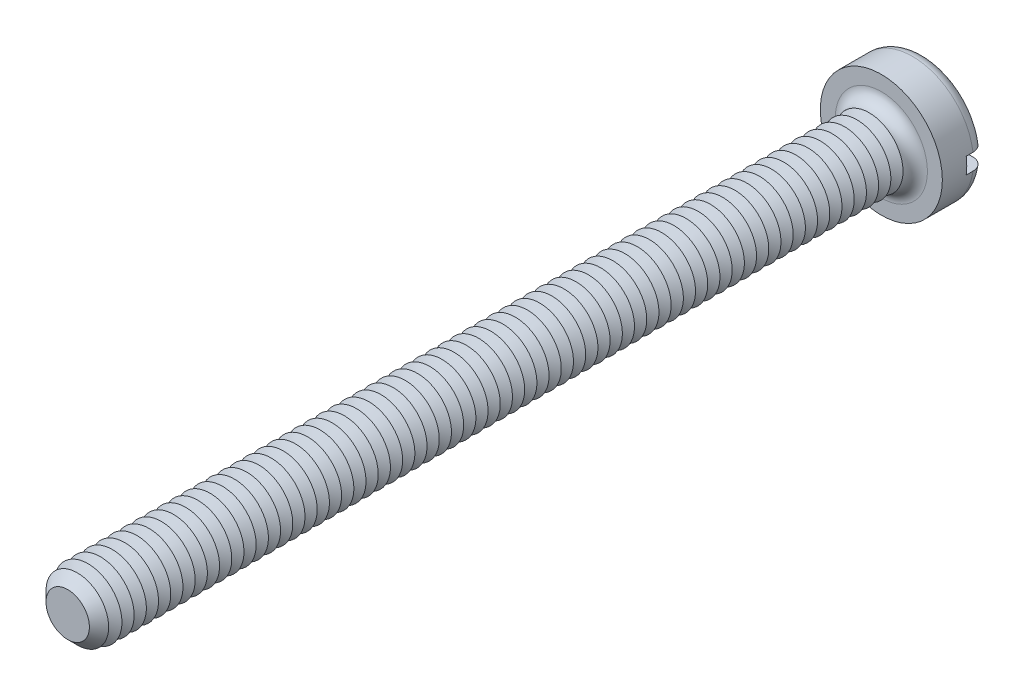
from build123d import *

# Parameters (mm, degrees)
SKETCH3_R           = 2.25
BOSS_EXTRUDE2_DEPTH = 1.6
SKETCH4_R           = 1.25
BOSS_EXTRUDE3_DEPTH = 30
FILLET1_R           = 0.45
CHAMFER1_SIZE       = 0.45
LPATTERN1_COUNT     = 65
LPATTERN1_PITCH     = 0.45
SKETCH8_W           = 4.5
SKETCH8_H           = 0.6
CUT_EXTRUDE1_DEPTH  = 0.7


with BuildPart() as part:
    # Sketch3 → Boss-Extrude2 (new body)
    with BuildSketch(Plane.XY):
        Circle(SKETCH3_R)
    extrude(amount=-BOSS_EXTRUDE2_DEPTH)

    # Sketch4 → Boss-Extrude3 (add)
    with BuildSketch(Plane.XY):
        Circle(SKETCH4_R)
    extrude(amount=BOSS_EXTRUDE3_DEPTH)

    # Fillet1
    fillet1_edges = [part.edges().sort_by_distance(p)[0] for p in [
        (-2.25, 0, -1.6),
        (-1.25, 0, 0),
    ]]
    fillet(fillet1_edges, radius=FILLET1_R)

    # Chamfer1
    chamfer1_edges = [part.edges().sort_by_distance(p)[0] for p in [
        (-1.25, 0, 30),
    ]]
    chamfer(chamfer1_edges, length=CHAMFER1_SIZE)

    # Sketch6 → Cut-Revolve1 (revolve, cut)
    with BuildSketch(Plane(origin=(0, 0, 0), x_dir=(0, 0, -1), z_dir=(1, 0, 0)), mode=Mode.PRIVATE) as cut_revolve1_sk:
        Polygon((-0.45, 1.25), (-0.675, 0.860288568), (-0.9, 1.25), align=None)
    cut_revolve1 = revolve(cut_revolve1_sk.sketch.rotate(Axis((0, 0, -1.694361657), (0, 0, 1)), 90), axis=Axis((0, 0, -1.694361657), (0, 0, 1)), mode=Mode.SUBTRACT)

    # LPattern1: Cut-Revolve1 ×65
    with Locations(*[(0, 0, i * LPATTERN1_PITCH) for i in range(1, LPATTERN1_COUNT)]):
        add(cut_revolve1, mode=Mode.SUBTRACT)

    # Sketch8 → Cut-Extrude1 (cut)
    with BuildSketch(Plane(origin=(0, 0, -1.6), x_dir=(-1, 0, 0), z_dir=(0, 0, -1))):
        Rectangle(SKETCH8_W, SKETCH8_H)
    extrude(amount=-CUT_EXTRUDE1_DEPTH, mode=Mode.SUBTRACT)


solid = part.part
